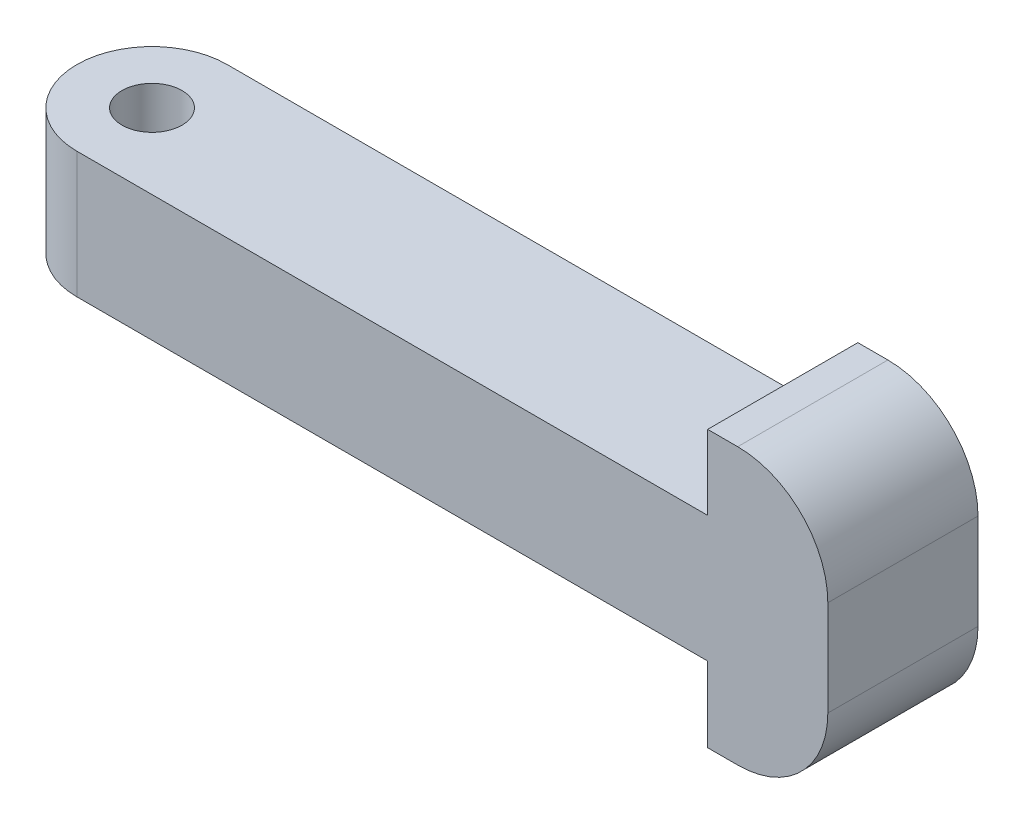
ISO-10303-21;
HEADER;
FILE_DESCRIPTION(('STEP AP214'),'2;1');
FILE_NAME('part.step','',(''),(''),'','','');
FILE_SCHEMA(('AUTOMOTIVE_DESIGN { 1 0 10303 214 1 1 1 1 }'));
ENDSEC;
DATA;
#1=APPLICATION_CONTEXT('core data for automotive mechanical design processes');
#2=APPLICATION_PROTOCOL_DEFINITION('international standard','automotive_design',2000,#1);
#3=PRODUCT_CONTEXT('',#1,'mechanical');
#4=PRODUCT('Part','Part','',(#3));
#5=PRODUCT_RELATED_PRODUCT_CATEGORY('part','',(#4));
#6=PRODUCT_DEFINITION_FORMATION('','',#4);
#7=PRODUCT_DEFINITION_CONTEXT('part definition',#1,'design');
#8=PRODUCT_DEFINITION('design','',#6,#7);
#9=PRODUCT_DEFINITION_SHAPE('','',#8);
#10=(LENGTH_UNIT() NAMED_UNIT(*) SI_UNIT(.MILLI.,.METRE.));
#11=(NAMED_UNIT(*) PLANE_ANGLE_UNIT() SI_UNIT($,.RADIAN.));
#12=(NAMED_UNIT(*) SI_UNIT($,.STERADIAN.) SOLID_ANGLE_UNIT());
#13=UNCERTAINTY_MEASURE_WITH_UNIT(LENGTH_MEASURE(1.E-05),#10,'distance_accuracy_value','');
#14=(GEOMETRIC_REPRESENTATION_CONTEXT(3) GLOBAL_UNCERTAINTY_ASSIGNED_CONTEXT((#13)) GLOBAL_UNIT_ASSIGNED_CONTEXT((#10,
#11,#12)) REPRESENTATION_CONTEXT('',''));
#15=CARTESIAN_POINT('',(0.,0.,0.));
#16=DIRECTION('',(0.,0.,1.));
#17=DIRECTION('',(1.,0.,0.));
#18=AXIS2_PLACEMENT_3D('',#15,#16,#17);
#19=CARTESIAN_POINT('',(0.,2.1,0.));
#20=DIRECTION('',(0.,1.,0.));
#21=DIRECTION('',(0.,0.,1.));
#22=AXIS2_PLACEMENT_3D('',#19,#20,#21);
#23=PLANE('',#22);
#24=CARTESIAN_POINT('',(0.,2.1,0.));
#25=DIRECTION('',(0.,1.,0.));
#26=DIRECTION('',(0.,0.,1.));
#27=AXIS2_PLACEMENT_3D('',#24,#25,#26);
#28=CIRCLE('',#27,2.5);
#29=CARTESIAN_POINT('',(0.,2.1,-2.5));
#30=VERTEX_POINT('',#29);
#31=CARTESIAN_POINT('',(-2.5,2.1,0.));
#32=VERTEX_POINT('',#31);
#33=EDGE_CURVE('E56',#30,#32,#28,.T.);
#34=ORIENTED_EDGE('',*,*,#33,.T.);
#35=CARTESIAN_POINT('',(0.,2.1,0.));
#36=DIRECTION('',(0.,1.,0.));
#37=DIRECTION('',(0.,0.,1.));
#38=AXIS2_PLACEMENT_3D('',#35,#36,#37);
#39=CIRCLE('',#38,2.5);
#40=CARTESIAN_POINT('',(0.,2.1,2.5));
#41=VERTEX_POINT('',#40);
#42=EDGE_CURVE('E44',#32,#41,#39,.T.);
#43=ORIENTED_EDGE('',*,*,#42,.T.);
#44=DIRECTION('',(1.,0.,0.));
#45=VECTOR('',#44,1.);
#46=CARTESIAN_POINT('',(-2.5,2.1,2.5));
#47=LINE('',#46,#45);
#48=CARTESIAN_POINT('',(21.,2.1,2.5));
#49=VERTEX_POINT('',#48);
#50=EDGE_CURVE('E177',#41,#49,#47,.T.);
#51=ORIENTED_EDGE('',*,*,#50,.T.);
#52=DIRECTION('',(0.,0.,-1.));
#53=VECTOR('',#52,1.);
#54=CARTESIAN_POINT('',(21.,2.1,-2.5));
#55=LINE('',#54,#53);
#56=CARTESIAN_POINT('',(21.,2.1,-2.5));
#57=VERTEX_POINT('',#56);
#58=EDGE_CURVE('E138',#49,#57,#55,.T.);
#59=ORIENTED_EDGE('',*,*,#58,.T.);
#60=DIRECTION('',(-1.,0.,0.));
#61=VECTOR('',#60,1.);
#62=CARTESIAN_POINT('',(-2.5,2.1,-2.5));
#63=LINE('',#62,#61);
#64=EDGE_CURVE('E175',#57,#30,#63,.T.);
#65=ORIENTED_EDGE('',*,*,#64,.T.);
#66=EDGE_LOOP('',(#34,#43,#51,#59,#65));
#67=FACE_BOUND('',#66,.T.);
#68=CARTESIAN_POINT('',(0.,2.1,0.));
#69=DIRECTION('',(0.,1.,0.));
#70=DIRECTION('',(0.,0.,1.));
#71=AXIS2_PLACEMENT_3D('',#68,#69,#70);
#72=CIRCLE('',#71,1.);
#73=CARTESIAN_POINT('',(0.,2.1,1.));
#74=VERTEX_POINT('',#73);
#75=EDGE_CURVE('E191',#74,#74,#72,.T.);
#76=ORIENTED_EDGE('',*,*,#75,.F.);
#77=EDGE_LOOP('',(#76));
#78=FACE_BOUND('',#77,.T.);
#79=ADVANCED_FACE('F35',(#67,#78),#23,.T.);
#80=CARTESIAN_POINT('',(0.,-2.1,0.));
#81=DIRECTION('',(0.,1.,0.));
#82=DIRECTION('',(0.,0.,1.));
#83=AXIS2_PLACEMENT_3D('',#80,#81,#82);
#84=PLANE('',#83);
#85=DIRECTION('',(1.,0.,0.));
#86=VECTOR('',#85,1.);
#87=CARTESIAN_POINT('',(-2.5,-2.1,2.5));
#88=LINE('',#87,#86);
#89=CARTESIAN_POINT('',(0.,-2.1,2.5));
#90=VERTEX_POINT('',#89);
#91=CARTESIAN_POINT('',(21.,-2.1,2.5));
#92=VERTEX_POINT('',#91);
#93=EDGE_CURVE('E194',#90,#92,#88,.T.);
#94=ORIENTED_EDGE('',*,*,#93,.F.);
#95=CARTESIAN_POINT('',(0.,-2.1,0.));
#96=DIRECTION('',(0.,1.,0.));
#97=DIRECTION('',(0.,0.,1.));
#98=AXIS2_PLACEMENT_3D('',#95,#96,#97);
#99=CIRCLE('',#98,2.5);
#100=CARTESIAN_POINT('',(-2.5,-2.1,0.));
#101=VERTEX_POINT('',#100);
#102=EDGE_CURVE('E407',#90,#101,#99,.F.);
#103=ORIENTED_EDGE('',*,*,#102,.T.);
#104=CARTESIAN_POINT('',(0.,-2.1,0.));
#105=DIRECTION('',(0.,1.,0.));
#106=DIRECTION('',(0.,0.,1.));
#107=AXIS2_PLACEMENT_3D('',#104,#105,#106);
#108=CIRCLE('',#107,2.5);
#109=CARTESIAN_POINT('',(0.,-2.1,-2.5));
#110=VERTEX_POINT('',#109);
#111=EDGE_CURVE('E411',#101,#110,#108,.F.);
#112=ORIENTED_EDGE('',*,*,#111,.T.);
#113=DIRECTION('',(-1.,0.,0.));
#114=VECTOR('',#113,1.);
#115=CARTESIAN_POINT('',(-2.5,-2.1,-2.5));
#116=LINE('',#115,#114);
#117=CARTESIAN_POINT('',(21.,-2.1,-2.5));
#118=VERTEX_POINT('',#117);
#119=EDGE_CURVE('E181',#118,#110,#116,.T.);
#120=ORIENTED_EDGE('',*,*,#119,.F.);
#121=DIRECTION('',(0.,0.,-1.));
#122=VECTOR('',#121,1.);
#123=CARTESIAN_POINT('',(21.,-2.1,-2.5));
#124=LINE('',#123,#122);
#125=EDGE_CURVE('E210',#92,#118,#124,.T.);
#126=ORIENTED_EDGE('',*,*,#125,.F.);
#127=EDGE_LOOP('',(#94,#103,#112,#120,#126));
#128=FACE_BOUND('',#127,.T.);
#129=CARTESIAN_POINT('',(0.,-2.1,0.));
#130=DIRECTION('',(0.,1.,0.));
#131=DIRECTION('',(0.,0.,1.));
#132=AXIS2_PLACEMENT_3D('',#129,#130,#131);
#133=CIRCLE('',#132,1.);
#134=CARTESIAN_POINT('',(0.,-2.1,1.));
#135=VERTEX_POINT('',#134);
#136=EDGE_CURVE('E167',#135,#135,#133,.T.);
#137=ORIENTED_EDGE('',*,*,#136,.T.);
#138=EDGE_LOOP('',(#137));
#139=FACE_BOUND('',#138,.T.);
#140=ADVANCED_FACE('F255',(#128,#139),#84,.F.);
#141=CARTESIAN_POINT('',(-2.5,2.1,2.5));
#142=DIRECTION('',(0.,0.,-1.));
#143=DIRECTION('',(-1.,0.,0.));
#144=AXIS2_PLACEMENT_3D('',#141,#142,#143);
#145=PLANE('',#144);
#146=ORIENTED_EDGE('',*,*,#50,.F.);
#147=DIRECTION('',(0.,-1.,0.));
#148=VECTOR('',#147,1.);
#149=CARTESIAN_POINT('',(0.,2.1,2.5));
#150=LINE('',#149,#148);
#151=EDGE_CURVE('E225',#41,#90,#150,.T.);
#152=ORIENTED_EDGE('',*,*,#151,.T.);
#153=ORIENTED_EDGE('',*,*,#93,.T.);
#154=DIRECTION('',(0.,-1.,0.));
#155=VECTOR('',#154,1.);
#156=CARTESIAN_POINT('',(21.,0.,2.5));
#157=LINE('',#156,#155);
#158=CARTESIAN_POINT('',(21.,-4.6,2.5));
#159=VERTEX_POINT('',#158);
#160=EDGE_CURVE('E141',#92,#159,#157,.T.);
#161=ORIENTED_EDGE('',*,*,#160,.T.);
#162=DIRECTION('',(1.,0.,0.));
#163=VECTOR('',#162,1.);
#164=CARTESIAN_POINT('',(0.,-4.6,2.5));
#165=LINE('',#164,#163);
#166=CARTESIAN_POINT('',(22.,-4.6,2.5));
#167=VERTEX_POINT('',#166);
#168=EDGE_CURVE('E131',#159,#167,#165,.T.);
#169=ORIENTED_EDGE('',*,*,#168,.T.);
#170=CARTESIAN_POINT('',(22.,-1.6,2.5));
#171=DIRECTION('',(0.,0.,-1.));
#172=DIRECTION('',(-1.,0.,0.));
#173=AXIS2_PLACEMENT_3D('',#170,#171,#172);
#174=CIRCLE('',#173,3.);
#175=CARTESIAN_POINT('',(25.,-1.6,2.5));
#176=VERTEX_POINT('',#175);
#177=EDGE_CURVE('E217',#167,#176,#174,.F.);
#178=ORIENTED_EDGE('',*,*,#177,.T.);
#179=DIRECTION('',(0.,-1.,0.));
#180=VECTOR('',#179,1.);
#181=CARTESIAN_POINT('',(25.,0.,2.5));
#182=LINE('',#181,#180);
#183=CARTESIAN_POINT('',(25.,1.58030698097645,2.5));
#184=VERTEX_POINT('',#183);
#185=EDGE_CURVE('E147',#184,#176,#182,.T.);
#186=ORIENTED_EDGE('',*,*,#185,.F.);
#187=CARTESIAN_POINT('',(22.,1.58030698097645,2.5));
#188=DIRECTION('',(0.,0.,-1.));
#189=DIRECTION('',(-1.,0.,0.));
#190=AXIS2_PLACEMENT_3D('',#187,#188,#189);
#191=CIRCLE('',#190,3.);
#192=CARTESIAN_POINT('',(22.,4.58030698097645,2.5));
#193=VERTEX_POINT('',#192);
#194=EDGE_CURVE('E146',#184,#193,#191,.F.);
#195=ORIENTED_EDGE('',*,*,#194,.T.);
#196=DIRECTION('',(1.,0.,0.));
#197=VECTOR('',#196,1.);
#198=CARTESIAN_POINT('',(0.,4.58030698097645,2.5));
#199=LINE('',#198,#197);
#200=CARTESIAN_POINT('',(21.,4.58030698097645,2.5));
#201=VERTEX_POINT('',#200);
#202=EDGE_CURVE('E124',#201,#193,#199,.T.);
#203=ORIENTED_EDGE('',*,*,#202,.F.);
#204=EDGE_CURVE('E135',#201,#49,#157,.T.);
#205=ORIENTED_EDGE('',*,*,#204,.T.);
#206=EDGE_LOOP('',(#146,#152,#153,#161,#169,#178,#186,#195,#203,#205));
#207=FACE_BOUND('',#206,.T.);
#208=ADVANCED_FACE('F143',(#207),#145,.F.);
#209=CARTESIAN_POINT('',(-2.5,2.1,-2.5));
#210=DIRECTION('',(0.,0.,1.));
#211=DIRECTION('',(1.,0.,0.));
#212=AXIS2_PLACEMENT_3D('',#209,#210,#211);
#213=PLANE('',#212);
#214=ORIENTED_EDGE('',*,*,#119,.T.);
#215=DIRECTION('',(0.,-1.,0.));
#216=VECTOR('',#215,1.);
#217=CARTESIAN_POINT('',(0.,2.1,-2.5));
#218=LINE('',#217,#216);
#219=EDGE_CURVE('E11',#110,#30,#218,.F.);
#220=ORIENTED_EDGE('',*,*,#219,.T.);
#221=ORIENTED_EDGE('',*,*,#64,.F.);
#222=DIRECTION('',(0.,-1.,0.));
#223=VECTOR('',#222,1.);
#224=CARTESIAN_POINT('',(21.,0.,-2.5));
#225=LINE('',#224,#223);
#226=CARTESIAN_POINT('',(21.,4.58030698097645,-2.5));
#227=VERTEX_POINT('',#226);
#228=EDGE_CURVE('E163',#227,#57,#225,.T.);
#229=ORIENTED_EDGE('',*,*,#228,.F.);
#230=DIRECTION('',(1.,0.,0.));
#231=VECTOR('',#230,1.);
#232=CARTESIAN_POINT('',(0.,4.58030698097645,-2.5));
#233=LINE('',#232,#231);
#234=CARTESIAN_POINT('',(22.,4.58030698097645,-2.5));
#235=VERTEX_POINT('',#234);
#236=EDGE_CURVE('E127',#227,#235,#233,.T.);
#237=ORIENTED_EDGE('',*,*,#236,.T.);
#238=CARTESIAN_POINT('',(22.,1.58030698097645,-2.5));
#239=DIRECTION('',(0.,0.,1.));
#240=DIRECTION('',(1.,0.,0.));
#241=AXIS2_PLACEMENT_3D('',#238,#239,#240);
#242=CIRCLE('',#241,3.);
#243=CARTESIAN_POINT('',(25.,1.58030698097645,-2.5));
#244=VERTEX_POINT('',#243);
#245=EDGE_CURVE('E174',#235,#244,#242,.F.);
#246=ORIENTED_EDGE('',*,*,#245,.T.);
#247=DIRECTION('',(0.,-1.,0.));
#248=VECTOR('',#247,1.);
#249=CARTESIAN_POINT('',(25.,0.,-2.5));
#250=LINE('',#249,#248);
#251=CARTESIAN_POINT('',(25.,-1.6,-2.5));
#252=VERTEX_POINT('',#251);
#253=EDGE_CURVE('E170',#244,#252,#250,.T.);
#254=ORIENTED_EDGE('',*,*,#253,.T.);
#255=CARTESIAN_POINT('',(22.,-1.6,-2.5));
#256=DIRECTION('',(0.,0.,1.));
#257=DIRECTION('',(1.,0.,0.));
#258=AXIS2_PLACEMENT_3D('',#255,#256,#257);
#259=CIRCLE('',#258,3.);
#260=CARTESIAN_POINT('',(22.,-4.6,-2.5));
#261=VERTEX_POINT('',#260);
#262=EDGE_CURVE('E212',#252,#261,#259,.F.);
#263=ORIENTED_EDGE('',*,*,#262,.T.);
#264=DIRECTION('',(1.,0.,0.));
#265=VECTOR('',#264,1.);
#266=CARTESIAN_POINT('',(0.,-4.6,-2.5));
#267=LINE('',#266,#265);
#268=CARTESIAN_POINT('',(21.,-4.6,-2.5));
#269=VERTEX_POINT('',#268);
#270=EDGE_CURVE('E168',#269,#261,#267,.T.);
#271=ORIENTED_EDGE('',*,*,#270,.F.);
#272=EDGE_CURVE('E161',#118,#269,#225,.T.);
#273=ORIENTED_EDGE('',*,*,#272,.F.);
#274=EDGE_LOOP('',(#214,#220,#221,#229,#237,#246,#254,#263,#271,#273));
#275=FACE_BOUND('',#274,.T.);
#276=ADVANCED_FACE('F173',(#275),#213,.F.);
#277=CARTESIAN_POINT('',(0.,2.1,0.));
#278=DIRECTION('',(0.,-1.,0.));
#279=DIRECTION('',(0.,0.,-1.));
#280=AXIS2_PLACEMENT_3D('',#277,#278,#279);
#281=CYLINDRICAL_SURFACE('',#280,1.);
#282=ORIENTED_EDGE('',*,*,#75,.T.);
#283=EDGE_LOOP('',(#282));
#284=FACE_BOUND('',#283,.T.);
#285=ORIENTED_EDGE('',*,*,#136,.F.);
#286=EDGE_LOOP('',(#285));
#287=FACE_BOUND('',#286,.T.);
#288=ADVANCED_FACE('F263',(#284,#287),#281,.F.);
#289=CARTESIAN_POINT('',(21.,0.,2.5));
#290=DIRECTION('',(1.,0.,0.));
#291=DIRECTION('',(0.,0.,-1.));
#292=AXIS2_PLACEMENT_3D('',#289,#290,#291);
#293=PLANE('',#292);
#294=ORIENTED_EDGE('',*,*,#160,.F.);
#295=ORIENTED_EDGE('',*,*,#125,.T.);
#296=ORIENTED_EDGE('',*,*,#272,.T.);
#297=DIRECTION('',(0.,0.,-1.));
#298=VECTOR('',#297,1.);
#299=CARTESIAN_POINT('',(21.,-4.6,2.5));
#300=LINE('',#299,#298);
#301=EDGE_CURVE('E130',#159,#269,#300,.T.);
#302=ORIENTED_EDGE('',*,*,#301,.F.);
#303=EDGE_LOOP('',(#294,#295,#296,#302));
#304=FACE_BOUND('',#303,.T.);
#305=ADVANCED_FACE('F207',(#304),#293,.F.);
#306=ORIENTED_EDGE('',*,*,#58,.F.);
#307=ORIENTED_EDGE('',*,*,#204,.F.);
#308=DIRECTION('',(0.,0.,-1.));
#309=VECTOR('',#308,1.);
#310=CARTESIAN_POINT('',(21.,4.58030698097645,2.5));
#311=LINE('',#310,#309);
#312=EDGE_CURVE('E119',#201,#227,#311,.T.);
#313=ORIENTED_EDGE('',*,*,#312,.T.);
#314=ORIENTED_EDGE('',*,*,#228,.T.);
#315=EDGE_LOOP('',(#306,#307,#313,#314));
#316=FACE_BOUND('',#315,.T.);
#317=ADVANCED_FACE('F136',(#316),#293,.F.);
#318=CARTESIAN_POINT('',(0.,-4.6,2.5));
#319=DIRECTION('',(0.,1.,0.));
#320=DIRECTION('',(0.,0.,1.));
#321=AXIS2_PLACEMENT_3D('',#318,#319,#320);
#322=PLANE('',#321);
#323=ORIENTED_EDGE('',*,*,#270,.T.);
#324=DIRECTION('',(0.,0.,-1.));
#325=VECTOR('',#324,1.);
#326=CARTESIAN_POINT('',(22.,-4.6,2.5));
#327=LINE('',#326,#325);
#328=EDGE_CURVE('E206',#261,#167,#327,.F.);
#329=ORIENTED_EDGE('',*,*,#328,.T.);
#330=ORIENTED_EDGE('',*,*,#168,.F.);
#331=ORIENTED_EDGE('',*,*,#301,.T.);
#332=EDGE_LOOP('',(#323,#329,#330,#331));
#333=FACE_BOUND('',#332,.T.);
#334=ADVANCED_FACE('F204',(#333),#322,.F.);
#335=CARTESIAN_POINT('',(25.,0.,2.5));
#336=DIRECTION('',(1.,0.,0.));
#337=DIRECTION('',(0.,0.,-1.));
#338=AXIS2_PLACEMENT_3D('',#335,#336,#337);
#339=PLANE('',#338);
#340=ORIENTED_EDGE('',*,*,#185,.T.);
#341=DIRECTION('',(0.,0.,-1.));
#342=VECTOR('',#341,1.);
#343=CARTESIAN_POINT('',(25.,-1.6,-2.5));
#344=LINE('',#343,#342);
#345=EDGE_CURVE('E239',#176,#252,#344,.T.);
#346=ORIENTED_EDGE('',*,*,#345,.T.);
#347=ORIENTED_EDGE('',*,*,#253,.F.);
#348=DIRECTION('',(0.,0.,-1.));
#349=VECTOR('',#348,1.);
#350=CARTESIAN_POINT('',(25.,1.58030698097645,2.5));
#351=LINE('',#350,#349);
#352=EDGE_CURVE('E179',#244,#184,#351,.F.);
#353=ORIENTED_EDGE('',*,*,#352,.T.);
#354=EDGE_LOOP('',(#340,#346,#347,#353));
#355=FACE_BOUND('',#354,.T.);
#356=ADVANCED_FACE('F241',(#355),#339,.T.);
#357=CARTESIAN_POINT('',(0.,4.58030698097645,2.5));
#358=DIRECTION('',(0.,1.,0.));
#359=DIRECTION('',(0.,0.,1.));
#360=AXIS2_PLACEMENT_3D('',#357,#358,#359);
#361=PLANE('',#360);
#362=ORIENTED_EDGE('',*,*,#202,.T.);
#363=DIRECTION('',(0.,0.,-1.));
#364=VECTOR('',#363,1.);
#365=CARTESIAN_POINT('',(22.,4.58030698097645,2.5));
#366=LINE('',#365,#364);
#367=EDGE_CURVE('E224',#193,#235,#366,.T.);
#368=ORIENTED_EDGE('',*,*,#367,.T.);
#369=ORIENTED_EDGE('',*,*,#236,.F.);
#370=ORIENTED_EDGE('',*,*,#312,.F.);
#371=EDGE_LOOP('',(#362,#368,#369,#370));
#372=FACE_BOUND('',#371,.T.);
#373=ADVANCED_FACE('F121',(#372),#361,.T.);
#374=CARTESIAN_POINT('',(22.,-1.6,2.5));
#375=DIRECTION('',(0.,0.,1.));
#376=DIRECTION('',(1.,0.,0.));
#377=AXIS2_PLACEMENT_3D('',#374,#375,#376);
#378=CYLINDRICAL_SURFACE('',#377,3.);
#379=ORIENTED_EDGE('',*,*,#177,.F.);
#380=ORIENTED_EDGE('',*,*,#328,.F.);
#381=ORIENTED_EDGE('',*,*,#262,.F.);
#382=ORIENTED_EDGE('',*,*,#345,.F.);
#383=EDGE_LOOP('',(#379,#380,#381,#382));
#384=FACE_BOUND('',#383,.T.);
#385=ADVANCED_FACE('F214',(#384),#378,.T.);
#386=CARTESIAN_POINT('',(22.,1.58030698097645,2.5));
#387=DIRECTION('',(0.,0.,-1.));
#388=DIRECTION('',(-1.,0.,0.));
#389=AXIS2_PLACEMENT_3D('',#386,#387,#388);
#390=CYLINDRICAL_SURFACE('',#389,3.);
#391=ORIENTED_EDGE('',*,*,#194,.F.);
#392=ORIENTED_EDGE('',*,*,#352,.F.);
#393=ORIENTED_EDGE('',*,*,#245,.F.);
#394=ORIENTED_EDGE('',*,*,#367,.F.);
#395=EDGE_LOOP('',(#391,#392,#393,#394));
#396=FACE_BOUND('',#395,.T.);
#397=ADVANCED_FACE('F244',(#396),#390,.T.);
#398=CARTESIAN_POINT('',(0.,2.1,0.));
#399=DIRECTION('',(0.,-1.,0.));
#400=DIRECTION('',(0.,0.,-1.));
#401=AXIS2_PLACEMENT_3D('',#398,#399,#400);
#402=CYLINDRICAL_SURFACE('',#401,2.5);
#403=DIRECTION('',(0.,-1.,0.));
#404=VECTOR('',#403,1.);
#405=CARTESIAN_POINT('',(-2.5,2.1,0.));
#406=LINE('',#405,#404);
#407=EDGE_CURVE('E39',#32,#101,#406,.T.);
#408=ORIENTED_EDGE('',*,*,#407,.F.);
#409=ORIENTED_EDGE('',*,*,#33,.F.);
#410=ORIENTED_EDGE('',*,*,#219,.F.);
#411=ORIENTED_EDGE('',*,*,#111,.F.);
#412=EDGE_LOOP('',(#408,#409,#410,#411));
#413=FACE_BOUND('',#412,.T.);
#414=ADVANCED_FACE('F37',(#413),#402,.T.);
#415=CARTESIAN_POINT('',(0.,2.1,0.));
#416=DIRECTION('',(0.,-1.,0.));
#417=DIRECTION('',(0.,0.,-1.));
#418=AXIS2_PLACEMENT_3D('',#415,#416,#417);
#419=CYLINDRICAL_SURFACE('',#418,2.5);
#420=ORIENTED_EDGE('',*,*,#42,.F.);
#421=ORIENTED_EDGE('',*,*,#407,.T.);
#422=ORIENTED_EDGE('',*,*,#102,.F.);
#423=ORIENTED_EDGE('',*,*,#151,.F.);
#424=EDGE_LOOP('',(#420,#421,#422,#423));
#425=FACE_BOUND('',#424,.T.);
#426=ADVANCED_FACE('F251',(#425),#419,.T.);
#427=CLOSED_SHELL('',(#79,#140,#208,#276,#288,#305,#317,#334,#356,#373,#385,#397,#414,#426));
#428=MANIFOLD_SOLID_BREP('B2',#427);
#429=ADVANCED_BREP_SHAPE_REPRESENTATION('',(#18,#428),#14);
#430=SHAPE_DEFINITION_REPRESENTATION(#9,#429);
ENDSEC;
END-ISO-10303-21;
